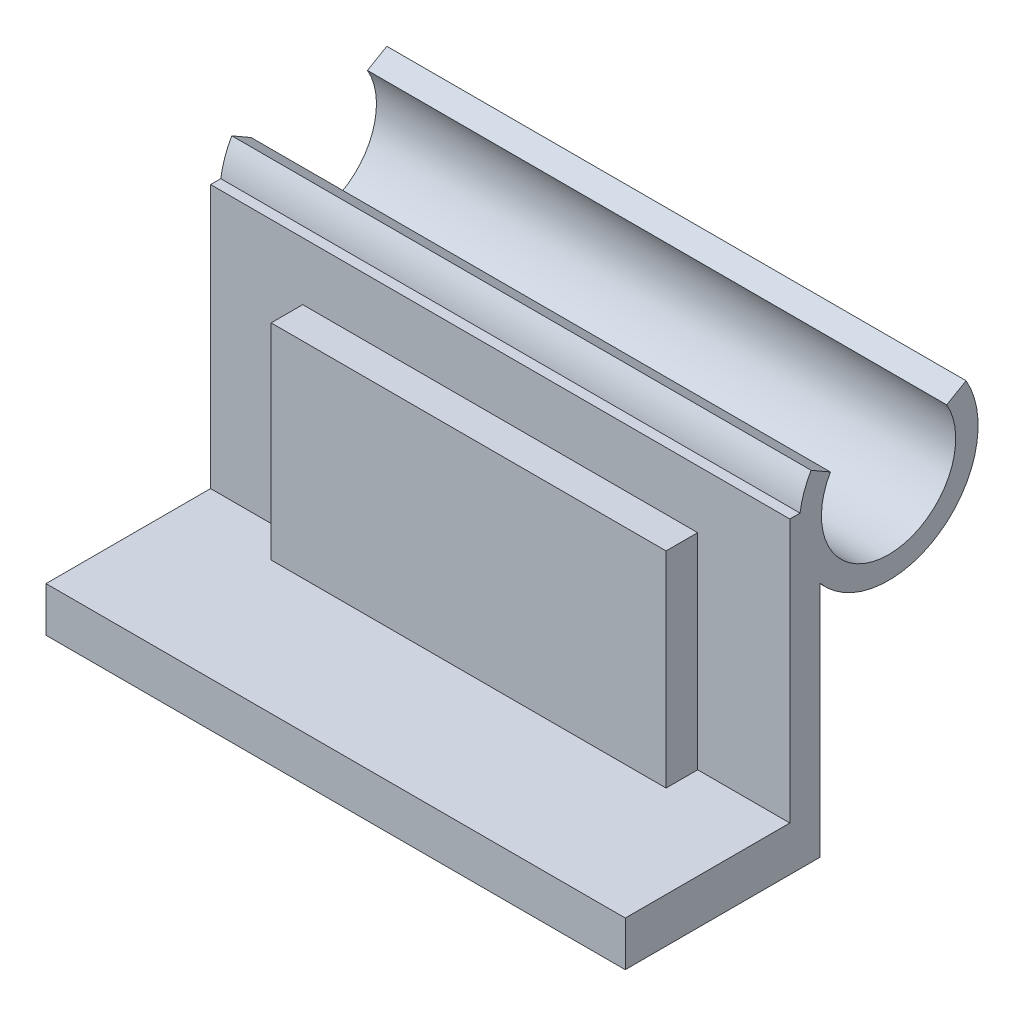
from build123d import *

# Parameters (mm, degrees)
SKETCH_1_W        = 1.15
SKETCH_1_H        = 11.7
F_01_PADDLE_DEPTH = 11
SKETCH_2_W        = 7.4
SKETCH_2_H        = 1.7
F_02_LIP_DEPTH    = 11
SKETCH_3_W        = 1.2
SKETCH_3_H        = 7.8
F_03_PAD_DEPTH    = 7.5
F_04_CLIP_DEPTH   = 11


with BuildPart() as part:
    # Sketch 1 → 01_PADDLE (new, symmetric)
    with BuildSketch(Plane(origin=(0, 0, 0), x_dir=(0, 0, -1), z_dir=(1, 0, 0))):
        with Locations((-3.175, -5.35)):
            Rectangle(SKETCH_1_W, SKETCH_1_H)
    extrude(amount=F_01_PADDLE_DEPTH, both=True)

    # Sketch 2 → 02_LIP (add, symmetric)
    with BuildSketch(Plane(origin=(0, 0, 0), x_dir=(0, 0, -1), z_dir=(1, 0, 0))):
        with Locations((-6.3, -10.35)):
            Rectangle(SKETCH_2_W, SKETCH_2_H)
    extrude(amount=F_02_LIP_DEPTH, both=True)

    # Sketch 3 → 03_PAD (add, symmetric)
    with BuildSketch(Plane(origin=(0, 0, 0), x_dir=(0, 0, -1), z_dir=(1, 0, 0))):
        with Locations((-4.35, -5.6)):
            Rectangle(SKETCH_3_W, SKETCH_3_H)
    extrude(amount=F_03_PAD_DEPTH, both=True)

    # Sketch 4 → 04_CLIP (add, symmetric)
    with BuildSketch(Plane(origin=(0, 0, 0), x_dir=(0, 0, -1), z_dir=(1, 0, 0))):
        with BuildLine():
            Line((2.944486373, 1.7), (2.20836478, 1.275))
            ThreePointArc((2.20836478, 1.275), (0, -2.55), (-2.20836478, 1.275))
            Line((-2.20836478, 1.275), (-2.944486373, 1.7))
            ThreePointArc((-2.944486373, 1.7), (0, -3.4), (2.944486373, 1.7))
        make_face()
    extrude(amount=F_04_CLIP_DEPTH, both=True)


solid = part.part
